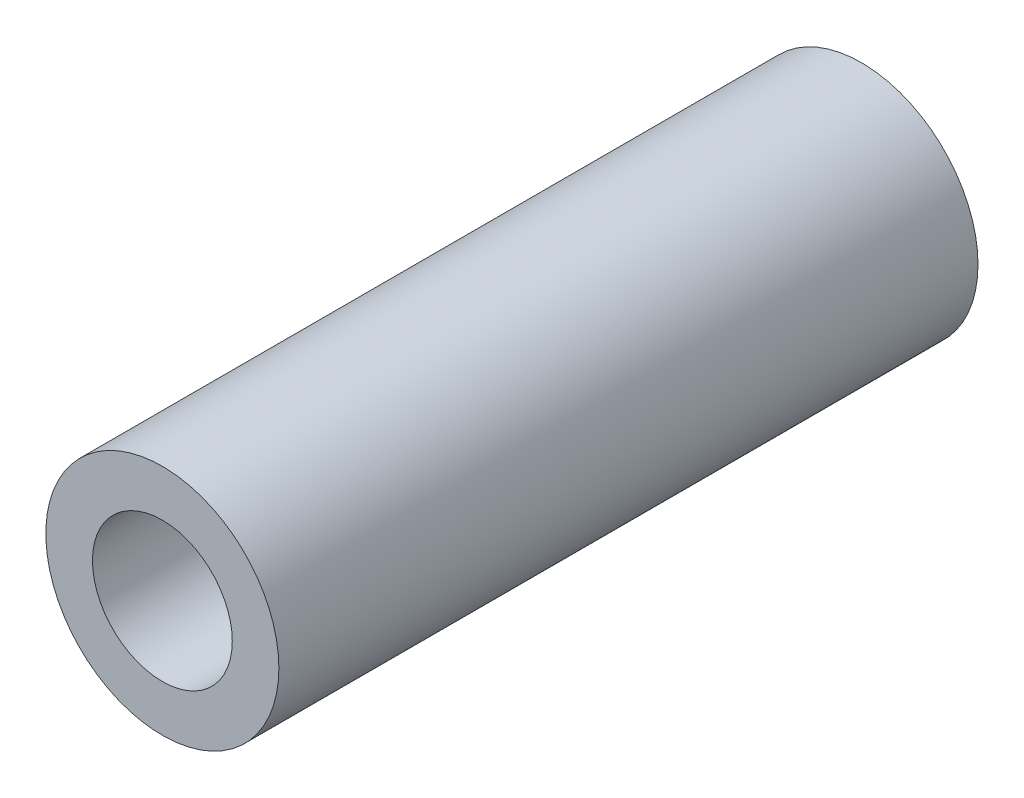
from build123d import *

# Parameters (mm, degrees)
SKIZZE1_R                       = 25
SKIZZE1_R_2                     = 15
AUFSATZ_LINEAR_AUSTRAGEN1_DEPTH = 150
SKIZZE2_R                       = 15
AUFSATZ_LINEAR_AUSTRAGEN2_DEPTH = 50


with BuildPart() as part:
    # Skizze1 → Aufsatz-Linear austragen1 (new body)
    with BuildSketch(Plane.XY):
        Circle(SKIZZE1_R)
        Circle(SKIZZE1_R_2, mode=Mode.SUBTRACT)
    extrude(amount=AUFSATZ_LINEAR_AUSTRAGEN1_DEPTH)

    # Skizze2 → Aufsatz-Linear austragen2 (add)
    with BuildSketch(Plane(origin=(0, 0, 0), x_dir=(-1, 0, 0), z_dir=(0, 0, -1))):
        Circle(SKIZZE2_R)
    extrude(amount=-AUFSATZ_LINEAR_AUSTRAGEN2_DEPTH)


solid = part.part
